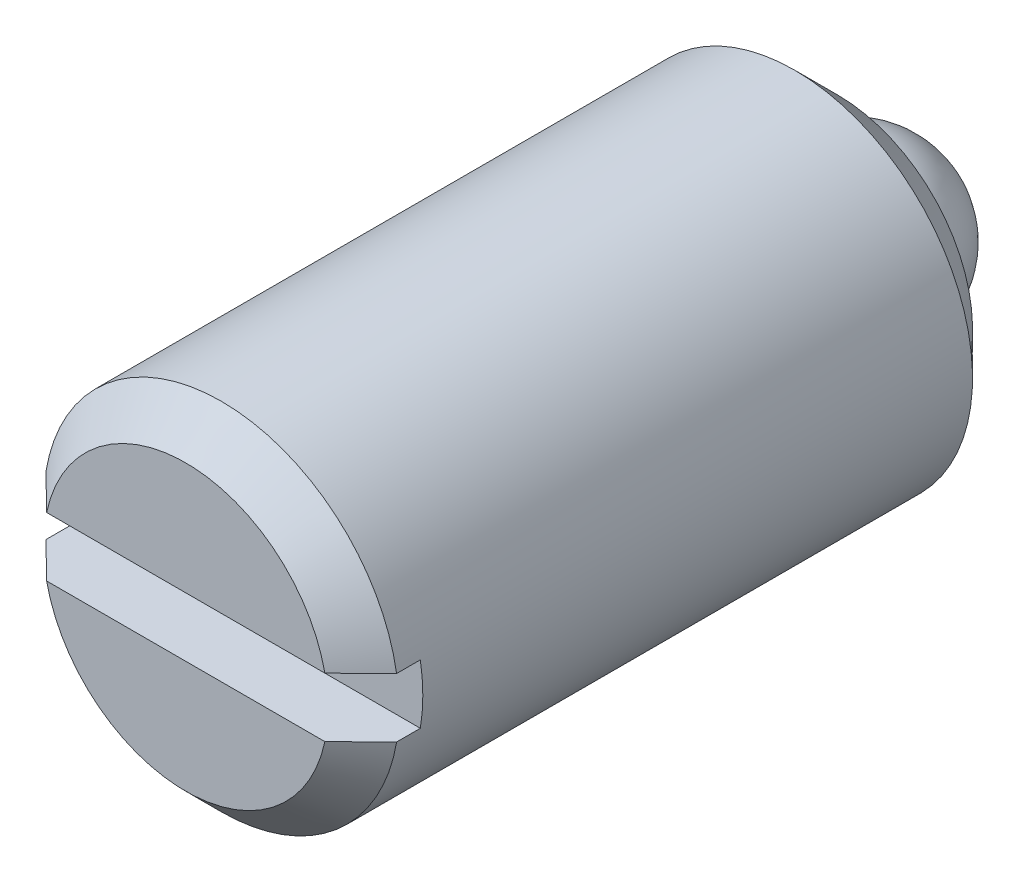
ISO-10303-21;
HEADER;
FILE_DESCRIPTION(('STEP AP214'),'2;1');
FILE_NAME('part.step','',(''),(''),'','','');
FILE_SCHEMA(('AUTOMOTIVE_DESIGN { 1 0 10303 214 1 1 1 1 }'));
ENDSEC;
DATA;
#1=APPLICATION_CONTEXT('core data for automotive mechanical design processes');
#2=APPLICATION_PROTOCOL_DEFINITION('international standard','automotive_design',2000,#1);
#3=PRODUCT_CONTEXT('',#1,'mechanical');
#4=PRODUCT('Part','Part','',(#3));
#5=PRODUCT_RELATED_PRODUCT_CATEGORY('part','',(#4));
#6=PRODUCT_DEFINITION_FORMATION('','',#4);
#7=PRODUCT_DEFINITION_CONTEXT('part definition',#1,'design');
#8=PRODUCT_DEFINITION('design','',#6,#7);
#9=PRODUCT_DEFINITION_SHAPE('','',#8);
#10=(LENGTH_UNIT() NAMED_UNIT(*) SI_UNIT(.MILLI.,.METRE.));
#11=(NAMED_UNIT(*) PLANE_ANGLE_UNIT() SI_UNIT($,.RADIAN.));
#12=(NAMED_UNIT(*) SI_UNIT($,.STERADIAN.) SOLID_ANGLE_UNIT());
#13=UNCERTAINTY_MEASURE_WITH_UNIT(LENGTH_MEASURE(1.E-05),#10,'distance_accuracy_value','');
#14=(GEOMETRIC_REPRESENTATION_CONTEXT(3) GLOBAL_UNCERTAINTY_ASSIGNED_CONTEXT((#13)) GLOBAL_UNIT_ASSIGNED_CONTEXT((#10,
#11,#12)) REPRESENTATION_CONTEXT('',''));
#15=CARTESIAN_POINT('',(0.,0.,0.));
#16=DIRECTION('',(0.,0.,1.));
#17=DIRECTION('',(1.,0.,0.));
#18=AXIS2_PLACEMENT_3D('',#15,#16,#17);
#19=CARTESIAN_POINT('',(0.,6.,25.5));
#20=DIRECTION('',(0.,0.,1.));
#21=DIRECTION('',(1.,0.,0.));
#22=AXIS2_PLACEMENT_3D('',#19,#20,#21);
#23=PLANE('',#22);
#24=DIRECTION('',(1.,0.,0.));
#25=VECTOR('',#24,1.);
#26=CARTESIAN_POINT('',(-5.91607978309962,1.,25.5));
#27=LINE('',#26,#25);
#28=CARTESIAN_POINT('',(-4.69467783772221,1.,25.5));
#29=VERTEX_POINT('',#28);
#30=CARTESIAN_POINT('',(4.69467783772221,1.,25.5));
#31=VERTEX_POINT('',#30);
#32=EDGE_CURVE('E75',#29,#31,#27,.T.);
#33=ORIENTED_EDGE('',*,*,#32,.T.);
#34=CARTESIAN_POINT('',(0.,0.,25.5));
#35=DIRECTION('',(0.,0.,1.));
#36=DIRECTION('',(0.,-1.,0.));
#37=AXIS2_PLACEMENT_3D('',#34,#35,#36);
#38=CIRCLE('',#37,4.8);
#39=EDGE_CURVE('E174',#31,#29,#38,.T.);
#40=ORIENTED_EDGE('',*,*,#39,.T.);
#41=EDGE_LOOP('',(#33,#40));
#42=FACE_BOUND('',#41,.T.);
#43=ADVANCED_FACE('F14',(#42),#23,.T.);
#44=CARTESIAN_POINT('',(0.,0.,-6.5));
#45=DIRECTION('',(0.,0.,-1.));
#46=DIRECTION('',(-1.,0.,0.));
#47=AXIS2_PLACEMENT_3D('',#44,#45,#46);
#48=CYLINDRICAL_SURFACE('',#47,6.);
#49=CARTESIAN_POINT('',(0.,0.,4.95));
#50=DIRECTION('',(0.,0.,-1.));
#51=DIRECTION('',(0.,1.,0.));
#52=AXIS2_PLACEMENT_3D('',#49,#50,#51);
#53=CIRCLE('',#52,6.);
#54=CARTESIAN_POINT('',(0.,6.,4.95));
#55=VERTEX_POINT('',#54);
#56=EDGE_CURVE('E106',#55,#55,#53,.F.);
#57=ORIENTED_EDGE('',*,*,#56,.T.);
#58=EDGE_LOOP('',(#57));
#59=FACE_BOUND('',#58,.T.);
#60=DIRECTION('',(0.,0.,1.));
#61=VECTOR('',#60,1.);
#62=CARTESIAN_POINT('',(-5.91607978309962,1.,23.5));
#63=LINE('',#62,#61);
#64=CARTESIAN_POINT('',(-5.91607978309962,1.,23.5));
#65=VERTEX_POINT('',#64);
#66=CARTESIAN_POINT('',(-5.91607978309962,1.,24.3));
#67=VERTEX_POINT('',#66);
#68=EDGE_CURVE('E95',#65,#67,#63,.T.);
#69=ORIENTED_EDGE('',*,*,#68,.T.);
#70=CARTESIAN_POINT('',(0.,0.,24.3));
#71=DIRECTION('',(0.,0.,1.));
#72=DIRECTION('',(0.,-1.,0.));
#73=AXIS2_PLACEMENT_3D('',#70,#71,#72);
#74=CIRCLE('',#73,6.);
#75=CARTESIAN_POINT('',(5.91607978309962,1.,24.3));
#76=VERTEX_POINT('',#75);
#77=EDGE_CURVE('E110',#67,#76,#74,.F.);
#78=ORIENTED_EDGE('',*,*,#77,.T.);
#79=DIRECTION('',(0.,0.,1.));
#80=VECTOR('',#79,1.);
#81=CARTESIAN_POINT('',(5.91607978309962,1.,23.5));
#82=LINE('',#81,#80);
#83=CARTESIAN_POINT('',(5.91607978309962,1.,23.5));
#84=VERTEX_POINT('',#83);
#85=EDGE_CURVE('E89',#84,#76,#82,.T.);
#86=ORIENTED_EDGE('',*,*,#85,.F.);
#87=CARTESIAN_POINT('',(0.,0.,23.5));
#88=DIRECTION('',(0.,0.,1.));
#89=DIRECTION('',(1.,0.,0.));
#90=AXIS2_PLACEMENT_3D('',#87,#88,#89);
#91=CIRCLE('',#90,6.);
#92=CARTESIAN_POINT('',(5.91607978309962,-1.,23.5));
#93=VERTEX_POINT('',#92);
#94=EDGE_CURVE('E77',#93,#84,#91,.T.);
#95=ORIENTED_EDGE('',*,*,#94,.F.);
#96=DIRECTION('',(0.,0.,1.));
#97=VECTOR('',#96,1.);
#98=CARTESIAN_POINT('',(5.91607978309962,-1.,23.5));
#99=LINE('',#98,#97);
#100=CARTESIAN_POINT('',(5.91607978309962,-1.,24.3));
#101=VERTEX_POINT('',#100);
#102=EDGE_CURVE('E81',#93,#101,#99,.T.);
#103=ORIENTED_EDGE('',*,*,#102,.T.);
#104=CARTESIAN_POINT('',(0.,0.,24.3));
#105=DIRECTION('',(0.,0.,1.));
#106=DIRECTION('',(0.,-1.,0.));
#107=AXIS2_PLACEMENT_3D('',#104,#105,#106);
#108=CIRCLE('',#107,6.);
#109=CARTESIAN_POINT('',(-5.91607978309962,-1.,24.3));
#110=VERTEX_POINT('',#109);
#111=EDGE_CURVE('E87',#101,#110,#108,.F.);
#112=ORIENTED_EDGE('',*,*,#111,.T.);
#113=DIRECTION('',(0.,0.,1.));
#114=VECTOR('',#113,1.);
#115=CARTESIAN_POINT('',(-5.91607978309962,-1.,23.5));
#116=LINE('',#115,#114);
#117=CARTESIAN_POINT('',(-5.91607978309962,-1.,23.5));
#118=VERTEX_POINT('',#117);
#119=EDGE_CURVE('E79',#118,#110,#116,.T.);
#120=ORIENTED_EDGE('',*,*,#119,.F.);
#121=EDGE_CURVE('E65',#65,#118,#91,.T.);
#122=ORIENTED_EDGE('',*,*,#121,.F.);
#123=EDGE_LOOP('',(#69,#78,#86,#95,#103,#112,#120,#122));
#124=FACE_BOUND('',#123,.T.);
#125=ADVANCED_FACE('F85',(#59,#124),#48,.T.);
#126=CARTESIAN_POINT('',(0.,3.,3.5));
#127=DIRECTION('',(0.,0.,-1.));
#128=DIRECTION('',(-1.,0.,0.));
#129=AXIS2_PLACEMENT_3D('',#126,#127,#128);
#130=PLANE('',#129);
#131=CARTESIAN_POINT('',(0.,0.,3.5));
#132=DIRECTION('',(0.,0.,-1.));
#133=DIRECTION('',(0.,1.,0.));
#134=AXIS2_PLACEMENT_3D('',#131,#132,#133);
#135=CIRCLE('',#134,4.55);
#136=CARTESIAN_POINT('',(0.,4.55,3.5));
#137=VERTEX_POINT('',#136);
#138=EDGE_CURVE('E103',#137,#137,#135,.T.);
#139=ORIENTED_EDGE('',*,*,#138,.T.);
#140=EDGE_LOOP('',(#139));
#141=FACE_BOUND('',#140,.T.);
#142=CARTESIAN_POINT('',(0.,0.,3.5));
#143=DIRECTION('',(0.,0.,-1.));
#144=DIRECTION('',(-1.,0.,0.));
#145=AXIS2_PLACEMENT_3D('',#142,#143,#144);
#146=CIRCLE('',#145,3.);
#147=CARTESIAN_POINT('',(-3.,0.,3.5));
#148=VERTEX_POINT('',#147);
#149=EDGE_CURVE('E100',#148,#148,#146,.T.);
#150=ORIENTED_EDGE('',*,*,#149,.F.);
#151=EDGE_LOOP('',(#150));
#152=FACE_BOUND('',#151,.T.);
#153=ADVANCED_FACE('F140',(#141,#152),#130,.T.);
#154=CARTESIAN_POINT('',(0.,0.,-6.5));
#155=DIRECTION('',(0.,0.,-1.));
#156=DIRECTION('',(-1.,0.,0.));
#157=AXIS2_PLACEMENT_3D('',#154,#155,#156);
#158=CYLINDRICAL_SURFACE('',#157,3.);
#159=CARTESIAN_POINT('',(0.,0.,3.));
#160=DIRECTION('',(0.,0.,-1.));
#161=DIRECTION('',(-1.,0.,0.));
#162=AXIS2_PLACEMENT_3D('',#159,#160,#161);
#163=CIRCLE('',#162,3.);
#164=CARTESIAN_POINT('',(-3.,0.,3.));
#165=VERTEX_POINT('',#164);
#166=EDGE_CURVE('E97',#165,#165,#163,.T.);
#167=ORIENTED_EDGE('',*,*,#166,.F.);
#168=EDGE_LOOP('',(#167));
#169=FACE_BOUND('',#168,.T.);
#170=ORIENTED_EDGE('',*,*,#149,.T.);
#171=EDGE_LOOP('',(#170));
#172=FACE_BOUND('',#171,.T.);
#173=ADVANCED_FACE('F143',(#169,#172),#158,.T.);
#174=CARTESIAN_POINT('',(0.,0.,3.));
#175=DIRECTION('',(-1.,0.,0.));
#176=DIRECTION('',(0.,0.,1.));
#177=AXIS2_PLACEMENT_3D('',#174,#175,#176);
#178=SPHERICAL_SURFACE('',#177,3.);
#179=CARTESIAN_POINT('',(0.,0.,3.));
#180=DIRECTION('',(0.,0.,-1.));
#181=DIRECTION('',(-1.,0.,0.));
#182=AXIS2_PLACEMENT_3D('',#179,#180,#181);
#183=SPHERICAL_SURFACE('',#182,3.);
#184=ORIENTED_EDGE('',*,*,#166,.T.);
#185=EDGE_LOOP('',(#184));
#186=FACE_BOUND('',#185,.T.);
#187=ADVANCED_FACE('F147',(#186),#183,.T.);
#188=DIRECTION('',(1.,0.,0.));
#189=VECTOR('',#188,1.);
#190=CARTESIAN_POINT('',(-5.91607978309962,-1.,25.5));
#191=LINE('',#190,#189);
#192=CARTESIAN_POINT('',(-4.69467783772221,-1.,25.5));
#193=VERTEX_POINT('',#192);
#194=CARTESIAN_POINT('',(4.69467783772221,-1.,25.5));
#195=VERTEX_POINT('',#194);
#196=EDGE_CURVE('E177',#193,#195,#191,.T.);
#197=ORIENTED_EDGE('',*,*,#196,.F.);
#198=CARTESIAN_POINT('',(0.,0.,25.5));
#199=DIRECTION('',(0.,0.,1.));
#200=DIRECTION('',(0.,-1.,0.));
#201=AXIS2_PLACEMENT_3D('',#198,#199,#200);
#202=CIRCLE('',#201,4.8);
#203=EDGE_CURVE('E9',#193,#195,#202,.T.);
#204=ORIENTED_EDGE('',*,*,#203,.T.);
#205=EDGE_LOOP('',(#197,#204));
#206=FACE_BOUND('',#205,.T.);
#207=ADVANCED_FACE('F151',(#206),#23,.T.);
#208=CARTESIAN_POINT('',(-5.91607978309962,1.,23.5));
#209=DIRECTION('',(0.,-1.,0.));
#210=DIRECTION('',(1.,0.,0.));
#211=AXIS2_PLACEMENT_3D('',#208,#209,#210);
#212=PLANE('',#211);
#213=ORIENTED_EDGE('',*,*,#85,.T.);
#214=CARTESIAN_POINT('',(5.91607978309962,1.,24.3));
#215=CARTESIAN_POINT('',(5.81447550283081,1.,24.4001822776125));
#216=CARTESIAN_POINT('',(5.71283625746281,1.,24.5003291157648));
#217=CARTESIAN_POINT('',(5.50947387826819,1.,24.7005373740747));
#218=CARTESIAN_POINT('',(5.40775074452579,1.,24.8005987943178));
#219=CARTESIAN_POINT('',(5.20420639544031,1.,25.00062190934));
#220=CARTESIAN_POINT('',(5.10238518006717,1.,25.1005836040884));
#221=CARTESIAN_POINT('',(4.89862484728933,1.,25.3003869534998));
#222=CARTESIAN_POINT('',(4.79668572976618,1.,25.4002286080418));
#223=CARTESIAN_POINT('',(4.69467783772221,1.,25.5));
#224=B_SPLINE_CURVE_WITH_KNOTS('',3,(#214,#215,#216,#217,#218,#219,#220,#221,#222,#223),
.UNSPECIFIED.,.F.,.F.,(4,2,2,2,4),(0.,0.428064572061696,0.856128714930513,1.28419298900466,
1.71225769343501),.UNSPECIFIED.);
#225=EDGE_CURVE('E120',#76,#31,#224,.T.);
#226=ORIENTED_EDGE('',*,*,#225,.T.);
#227=ORIENTED_EDGE('',*,*,#32,.F.);
#228=CARTESIAN_POINT('',(-4.69467783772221,1.,25.5));
#229=CARTESIAN_POINT('',(-4.79668572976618,1.,25.4002286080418));
#230=CARTESIAN_POINT('',(-4.89862484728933,1.,25.3003869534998));
#231=CARTESIAN_POINT('',(-5.10238518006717,1.,25.1005836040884));
#232=CARTESIAN_POINT('',(-5.20420639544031,1.,25.00062190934));
#233=CARTESIAN_POINT('',(-5.40775074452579,1.,24.8005987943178));
#234=CARTESIAN_POINT('',(-5.50947387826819,1.,24.7005373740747));
#235=CARTESIAN_POINT('',(-5.71283625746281,1.,24.5003291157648));
#236=CARTESIAN_POINT('',(-5.81447550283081,1.,24.4001822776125));
#237=CARTESIAN_POINT('',(-5.91607978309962,1.,24.3));
#238=B_SPLINE_CURVE_WITH_KNOTS('',3,(#228,#229,#230,#231,#232,#233,#234,#235,#236,#237),
.UNSPECIFIED.,.F.,.F.,(4,2,2,2,4),(0.,0.428064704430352,0.8561289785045,1.28419312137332,
1.71225769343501),.UNSPECIFIED.);
#239=EDGE_CURVE('E113',#29,#67,#238,.T.);
#240=ORIENTED_EDGE('',*,*,#239,.T.);
#241=ORIENTED_EDGE('',*,*,#68,.F.);
#242=DIRECTION('',(1.,0.,0.));
#243=VECTOR('',#242,1.);
#244=CARTESIAN_POINT('',(-5.91607978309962,1.,23.5));
#245=LINE('',#244,#243);
#246=EDGE_CURVE('E71',#65,#84,#245,.T.);
#247=ORIENTED_EDGE('',*,*,#246,.T.);
#248=EDGE_LOOP('',(#213,#226,#227,#240,#241,#247));
#249=FACE_BOUND('',#248,.T.);
#250=ADVANCED_FACE('F126',(#249),#212,.T.);
#251=CARTESIAN_POINT('',(-5.91607978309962,-1.,23.5));
#252=DIRECTION('',(0.,-1.,0.));
#253=DIRECTION('',(1.,0.,0.));
#254=AXIS2_PLACEMENT_3D('',#251,#252,#253);
#255=PLANE('',#254);
#256=ORIENTED_EDGE('',*,*,#119,.T.);
#257=CARTESIAN_POINT('',(-5.91607978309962,-1.,24.3));
#258=CARTESIAN_POINT('',(-5.81447550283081,-1.,24.4001822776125));
#259=CARTESIAN_POINT('',(-5.71283625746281,-1.,24.5003291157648));
#260=CARTESIAN_POINT('',(-5.50947387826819,-1.,24.7005373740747));
#261=CARTESIAN_POINT('',(-5.40775074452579,-1.,24.8005987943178));
#262=CARTESIAN_POINT('',(-5.20420639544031,-1.,25.00062190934));
#263=CARTESIAN_POINT('',(-5.10238518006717,-1.,25.1005836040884));
#264=CARTESIAN_POINT('',(-4.89862484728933,-1.,25.3003869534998));
#265=CARTESIAN_POINT('',(-4.79668572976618,-1.,25.4002286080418));
#266=CARTESIAN_POINT('',(-4.69467783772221,-1.,25.5));
#267=B_SPLINE_CURVE_WITH_KNOTS('',3,(#257,#258,#259,#260,#261,#262,#263,#264,#265,#266),
.UNSPECIFIED.,.F.,.F.,(4,2,2,2,4),(0.,0.428064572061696,0.856128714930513,1.28419298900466,
1.71225769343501),.UNSPECIFIED.);
#268=EDGE_CURVE('E23',#110,#193,#267,.T.);
#269=ORIENTED_EDGE('',*,*,#268,.T.);
#270=ORIENTED_EDGE('',*,*,#196,.T.);
#271=CARTESIAN_POINT('',(4.69467783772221,-1.,25.5));
#272=CARTESIAN_POINT('',(4.79668572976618,-1.,25.4002286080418));
#273=CARTESIAN_POINT('',(4.89862484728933,-1.,25.3003869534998));
#274=CARTESIAN_POINT('',(5.10238518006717,-1.,25.1005836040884));
#275=CARTESIAN_POINT('',(5.2042063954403,-1.,25.00062190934));
#276=CARTESIAN_POINT('',(5.40775074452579,-1.,24.8005987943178));
#277=CARTESIAN_POINT('',(5.50947387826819,-1.,24.7005373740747));
#278=CARTESIAN_POINT('',(5.71283625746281,-1.,24.5003291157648));
#279=CARTESIAN_POINT('',(5.81447550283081,-1.,24.4001822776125));
#280=CARTESIAN_POINT('',(5.91607978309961,-1.,24.3));
#281=B_SPLINE_CURVE_WITH_KNOTS('',3,(#271,#272,#273,#274,#275,#276,#277,#278,#279,#280),
.UNSPECIFIED.,.F.,.F.,(4,2,2,2,4),(0.,0.428064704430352,0.856128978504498,1.28419312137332,
1.71225769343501),.UNSPECIFIED.);
#282=EDGE_CURVE('E180',#195,#101,#281,.T.);
#283=ORIENTED_EDGE('',*,*,#282,.T.);
#284=ORIENTED_EDGE('',*,*,#102,.F.);
#285=DIRECTION('',(1.,0.,0.));
#286=VECTOR('',#285,1.);
#287=CARTESIAN_POINT('',(-5.91607978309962,-1.,23.5));
#288=LINE('',#287,#286);
#289=EDGE_CURVE('E68',#118,#93,#288,.T.);
#290=ORIENTED_EDGE('',*,*,#289,.F.);
#291=EDGE_LOOP('',(#256,#269,#270,#283,#284,#290));
#292=FACE_BOUND('',#291,.T.);
#293=ADVANCED_FACE('F78',(#292),#255,.F.);
#294=CARTESIAN_POINT('',(0.,0.,23.5));
#295=DIRECTION('',(0.,0.,1.));
#296=DIRECTION('',(1.,0.,0.));
#297=AXIS2_PLACEMENT_3D('',#294,#295,#296);
#298=PLANE('',#297);
#299=ORIENTED_EDGE('',*,*,#121,.T.);
#300=ORIENTED_EDGE('',*,*,#289,.T.);
#301=ORIENTED_EDGE('',*,*,#94,.T.);
#302=ORIENTED_EDGE('',*,*,#246,.F.);
#303=EDGE_LOOP('',(#299,#300,#301,#302));
#304=FACE_BOUND('',#303,.T.);
#305=ADVANCED_FACE('F67',(#304),#298,.T.);
#306=CARTESIAN_POINT('',(0.,0.,3.5));
#307=DIRECTION('',(0.,0.,1.));
#308=DIRECTION('',(0.,-1.,0.));
#309=AXIS2_PLACEMENT_3D('',#306,#307,#308);
#310=CONICAL_SURFACE('',#309,4.55,0.785398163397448);
#311=ORIENTED_EDGE('',*,*,#56,.F.);
#312=EDGE_LOOP('',(#311));
#313=FACE_BOUND('',#312,.T.);
#314=ORIENTED_EDGE('',*,*,#138,.F.);
#315=EDGE_LOOP('',(#314));
#316=FACE_BOUND('',#315,.T.);
#317=ADVANCED_FACE('F134',(#313,#316),#310,.T.);
#318=CARTESIAN_POINT('',(0.,0.,24.3));
#319=DIRECTION('',(0.,0.,-1.));
#320=DIRECTION('',(0.,1.,0.));
#321=AXIS2_PLACEMENT_3D('',#318,#319,#320);
#322=CONICAL_SURFACE('',#321,6.,0.785398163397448);
#323=ORIENTED_EDGE('',*,*,#239,.F.);
#324=ORIENTED_EDGE('',*,*,#39,.F.);
#325=ORIENTED_EDGE('',*,*,#225,.F.);
#326=ORIENTED_EDGE('',*,*,#77,.F.);
#327=EDGE_LOOP('',(#323,#324,#325,#326));
#328=FACE_BOUND('',#327,.T.);
#329=ADVANCED_FACE('F130',(#328),#322,.T.);
#330=CARTESIAN_POINT('',(0.,0.,24.3));
#331=DIRECTION('',(0.,0.,-1.));
#332=DIRECTION('',(0.,1.,0.));
#333=AXIS2_PLACEMENT_3D('',#330,#331,#332);
#334=CONICAL_SURFACE('',#333,6.,0.785398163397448);
#335=ORIENTED_EDGE('',*,*,#282,.F.);
#336=ORIENTED_EDGE('',*,*,#203,.F.);
#337=ORIENTED_EDGE('',*,*,#268,.F.);
#338=ORIENTED_EDGE('',*,*,#111,.F.);
#339=EDGE_LOOP('',(#335,#336,#337,#338));
#340=FACE_BOUND('',#339,.T.);
#341=ADVANCED_FACE('F16',(#340),#334,.T.);
#342=CLOSED_SHELL('',(#43,#125,#153,#173,#187,#207,#250,#293,#305,#317,#329,#341));
#343=MANIFOLD_SOLID_BREP('B1',#342);
#344=ADVANCED_BREP_SHAPE_REPRESENTATION('',(#18,#343),#14);
#345=SHAPE_DEFINITION_REPRESENTATION(#9,#344);
ENDSEC;
END-ISO-10303-21;
